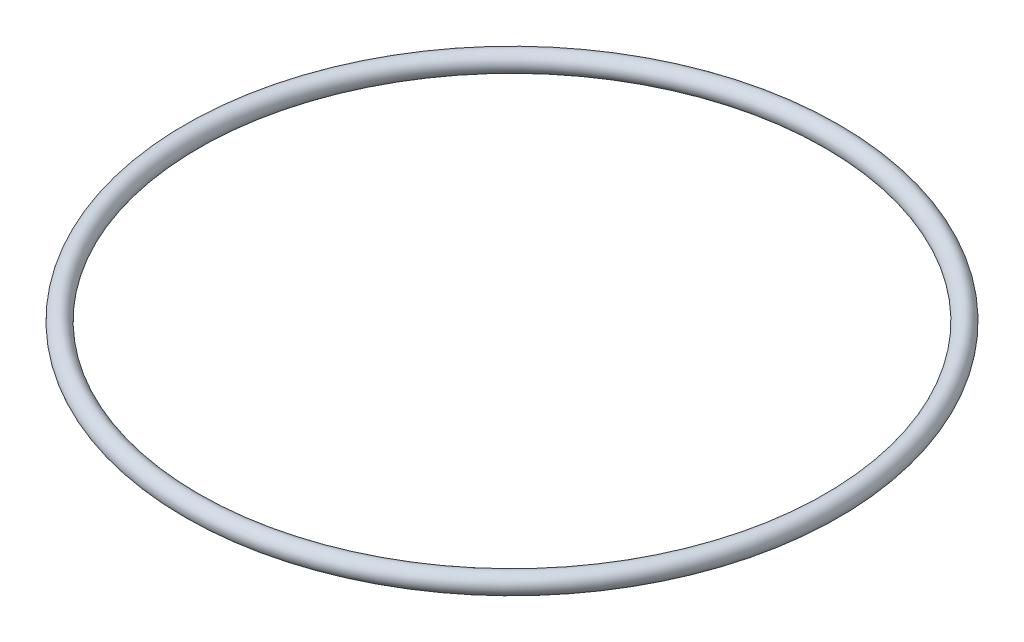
ISO-10303-21;
HEADER;
FILE_DESCRIPTION(('STEP AP214'),'2;1');
FILE_NAME('part.step','',(''),(''),'','','');
FILE_SCHEMA(('AUTOMOTIVE_DESIGN { 1 0 10303 214 1 1 1 1 }'));
ENDSEC;
DATA;
#1=APPLICATION_CONTEXT('core data for automotive mechanical design processes');
#2=APPLICATION_PROTOCOL_DEFINITION('international standard','automotive_design',2000,#1);
#3=PRODUCT_CONTEXT('',#1,'mechanical');
#4=PRODUCT('Part','Part','',(#3));
#5=PRODUCT_RELATED_PRODUCT_CATEGORY('part','',(#4));
#6=PRODUCT_DEFINITION_FORMATION('','',#4);
#7=PRODUCT_DEFINITION_CONTEXT('part definition',#1,'design');
#8=PRODUCT_DEFINITION('design','',#6,#7);
#9=PRODUCT_DEFINITION_SHAPE('','',#8);
#10=(LENGTH_UNIT() NAMED_UNIT(*) SI_UNIT(.MILLI.,.METRE.));
#11=(NAMED_UNIT(*) PLANE_ANGLE_UNIT() SI_UNIT($,.RADIAN.));
#12=(NAMED_UNIT(*) SI_UNIT($,.STERADIAN.) SOLID_ANGLE_UNIT());
#13=UNCERTAINTY_MEASURE_WITH_UNIT(LENGTH_MEASURE(1.E-05),#10,'distance_accuracy_value','');
#14=(GEOMETRIC_REPRESENTATION_CONTEXT(3) GLOBAL_UNCERTAINTY_ASSIGNED_CONTEXT((#13)) GLOBAL_UNIT_ASSIGNED_CONTEXT((#10,
#11,#12)) REPRESENTATION_CONTEXT('',''));
#15=CARTESIAN_POINT('',(0.,0.,0.));
#16=DIRECTION('',(0.,0.,1.));
#17=DIRECTION('',(1.,0.,0.));
#18=AXIS2_PLACEMENT_3D('',#15,#16,#17);
#19=CARTESIAN_POINT('',(0.,0.,0.));
#20=DIRECTION('',(0.,1.,0.));
#21=DIRECTION('',(0.,0.,1.));
#22=AXIS2_PLACEMENT_3D('',#19,#20,#21);
#23=TOROIDAL_SURFACE('',#22,50.8,1.524);
#24=CARTESIAN_POINT('',(0.,0.,50.8));
#25=DIRECTION('',(1.,0.,0.));
#26=DIRECTION('',(0.,0.,-1.));
#27=AXIS2_PLACEMENT_3D('',#24,#25,#26);
#28=CIRCLE('',#27,1.524);
#29=CARTESIAN_POINT('',(0.,0.,52.324));
#30=VERTEX_POINT('',#29);
#31=EDGE_CURVE('E10',#30,#30,#28,.T.);
#32=CARTESIAN_POINT('',(0.,0.,0.));
#33=DIRECTION('',(0.,1.,0.));
#34=DIRECTION('',(0.,0.,1.));
#35=AXIS2_PLACEMENT_3D('',#32,#33,#34);
#36=CIRCLE('',#35,52.324);
#37=EDGE_CURVE('',#30,#30,#36,.T.);
#38=ORIENTED_EDGE('',*,*,#31,.T.);
#39=ORIENTED_EDGE('',*,*,#31,.F.);
#40=ORIENTED_EDGE('',*,*,#37,.T.);
#41=ORIENTED_EDGE('',*,*,#37,.F.);
#42=EDGE_LOOP('',(#38,#40,#39,#41));
#43=FACE_BOUND('',#42,.T.);
#44=ADVANCED_FACE('F37',(#43),#23,.T.);
#45=CLOSED_SHELL('',(#44));
#46=MANIFOLD_SOLID_BREP('B2',#45);
#47=ADVANCED_BREP_SHAPE_REPRESENTATION('',(#18,#46),#14);
#48=SHAPE_DEFINITION_REPRESENTATION(#9,#47);
ENDSEC;
END-ISO-10303-21;
